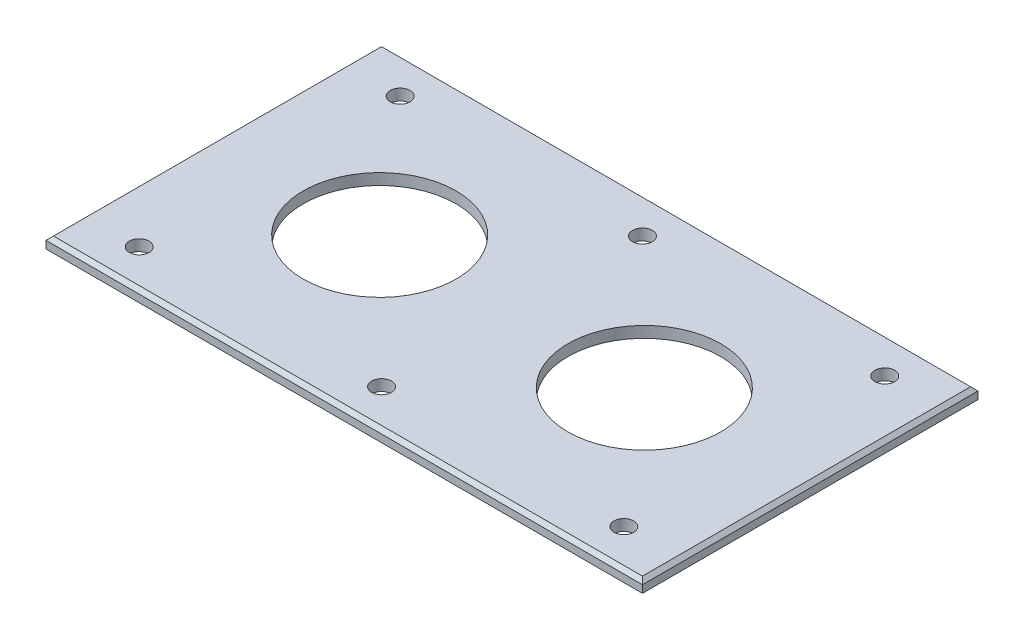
ISO-10303-21;
HEADER;
FILE_DESCRIPTION(('STEP AP214'),'2;1');
FILE_NAME('part.step','',(''),(''),'','','');
FILE_SCHEMA(('AUTOMOTIVE_DESIGN { 1 0 10303 214 1 1 1 1 }'));
ENDSEC;
DATA;
#1=APPLICATION_CONTEXT('core data for automotive mechanical design processes');
#2=APPLICATION_PROTOCOL_DEFINITION('international standard','automotive_design',2000,#1);
#3=PRODUCT_CONTEXT('',#1,'mechanical');
#4=PRODUCT('Part','Part','',(#3));
#5=PRODUCT_RELATED_PRODUCT_CATEGORY('part','',(#4));
#6=PRODUCT_DEFINITION_FORMATION('','',#4);
#7=PRODUCT_DEFINITION_CONTEXT('part definition',#1,'design');
#8=PRODUCT_DEFINITION('design','',#6,#7);
#9=PRODUCT_DEFINITION_SHAPE('','',#8);
#10=(LENGTH_UNIT() NAMED_UNIT(*) SI_UNIT(.MILLI.,.METRE.));
#11=(NAMED_UNIT(*) PLANE_ANGLE_UNIT() SI_UNIT($,.RADIAN.));
#12=(NAMED_UNIT(*) SI_UNIT($,.STERADIAN.) SOLID_ANGLE_UNIT());
#13=UNCERTAINTY_MEASURE_WITH_UNIT(LENGTH_MEASURE(1.E-05),#10,'distance_accuracy_value','');
#14=(GEOMETRIC_REPRESENTATION_CONTEXT(3) GLOBAL_UNCERTAINTY_ASSIGNED_CONTEXT((#13)) GLOBAL_UNIT_ASSIGNED_CONTEXT((#10,
#11,#12)) REPRESENTATION_CONTEXT('',''));
#15=CARTESIAN_POINT('',(0.,0.,0.));
#16=DIRECTION('',(0.,0.,1.));
#17=DIRECTION('',(1.,0.,0.));
#18=AXIS2_PLACEMENT_3D('',#15,#16,#17);
#19=CARTESIAN_POINT('',(0.,14.,0.));
#20=DIRECTION('',(-1.,0.,0.));
#21=DIRECTION('',(0.,0.,1.));
#22=AXIS2_PLACEMENT_3D('',#19,#20,#21);
#23=PLANE('',#22);
#24=DIRECTION('',(0.,-1.,0.));
#25=VECTOR('',#24,1.);
#26=CARTESIAN_POINT('',(0.,14.,-90.));
#27=LINE('',#26,#25);
#28=CARTESIAN_POINT('',(0.,15.,-90.));
#29=VERTEX_POINT('',#28);
#30=CARTESIAN_POINT('',(0.,13.,-90.));
#31=VERTEX_POINT('',#30);
#32=EDGE_CURVE('E100',#29,#31,#27,.T.);
#33=ORIENTED_EDGE('',*,*,#32,.F.);
#34=DIRECTION('',(0.,0.,1.));
#35=VECTOR('',#34,1.);
#36=CARTESIAN_POINT('',(0.,15.,0.));
#37=LINE('',#36,#35);
#38=CARTESIAN_POINT('',(0.,15.,0.));
#39=VERTEX_POINT('',#38);
#40=EDGE_CURVE('E46',#29,#39,#37,.T.);
#41=ORIENTED_EDGE('',*,*,#40,.T.);
#42=DIRECTION('',(0.,-1.,0.));
#43=VECTOR('',#42,1.);
#44=CARTESIAN_POINT('',(0.,14.,0.));
#45=LINE('',#44,#43);
#46=CARTESIAN_POINT('',(0.,13.,0.));
#47=VERTEX_POINT('',#46);
#48=EDGE_CURVE('E133',#39,#47,#45,.T.);
#49=ORIENTED_EDGE('',*,*,#48,.T.);
#50=DIRECTION('',(0.,0.,1.));
#51=VECTOR('',#50,1.);
#52=CARTESIAN_POINT('',(0.,13.,0.));
#53=LINE('',#52,#51);
#54=EDGE_CURVE('E114',#31,#47,#53,.T.);
#55=ORIENTED_EDGE('',*,*,#54,.F.);
#56=EDGE_LOOP('',(#33,#41,#49,#55));
#57=FACE_BOUND('',#56,.T.);
#58=ADVANCED_FACE('F36',(#57),#23,.F.);
#59=CARTESIAN_POINT('',(0.,14.,-90.));
#60=DIRECTION('',(0.,0.,1.));
#61=DIRECTION('',(1.,0.,0.));
#62=AXIS2_PLACEMENT_3D('',#59,#60,#61);
#63=PLANE('',#62);
#64=DIRECTION('',(0.,-1.,0.));
#65=VECTOR('',#64,1.);
#66=CARTESIAN_POINT('',(-160.,14.,-90.));
#67=LINE('',#66,#65);
#68=CARTESIAN_POINT('',(-160.,15.,-90.));
#69=VERTEX_POINT('',#68);
#70=CARTESIAN_POINT('',(-160.,13.,-90.));
#71=VERTEX_POINT('',#70);
#72=EDGE_CURVE('E91',#69,#71,#67,.T.);
#73=ORIENTED_EDGE('',*,*,#72,.F.);
#74=DIRECTION('',(1.,0.,0.));
#75=VECTOR('',#74,1.);
#76=CARTESIAN_POINT('',(0.,15.,-90.));
#77=LINE('',#76,#75);
#78=EDGE_CURVE('E61',#69,#29,#77,.T.);
#79=ORIENTED_EDGE('',*,*,#78,.T.);
#80=ORIENTED_EDGE('',*,*,#32,.T.);
#81=DIRECTION('',(1.,0.,0.));
#82=VECTOR('',#81,1.);
#83=CARTESIAN_POINT('',(-160.,13.,-90.));
#84=LINE('',#83,#82);
#85=EDGE_CURVE('E109',#71,#31,#84,.T.);
#86=ORIENTED_EDGE('',*,*,#85,.F.);
#87=EDGE_LOOP('',(#73,#79,#80,#86));
#88=FACE_BOUND('',#87,.T.);
#89=ADVANCED_FACE('F116',(#88),#63,.F.);
#90=CARTESIAN_POINT('',(-160.,14.,0.));
#91=DIRECTION('',(1.,0.,0.));
#92=DIRECTION('',(0.,0.,-1.));
#93=AXIS2_PLACEMENT_3D('',#90,#91,#92);
#94=PLANE('',#93);
#95=DIRECTION('',(0.,-1.,0.));
#96=VECTOR('',#95,1.);
#97=CARTESIAN_POINT('',(-160.,14.,0.));
#98=LINE('',#97,#96);
#99=CARTESIAN_POINT('',(-160.,15.,0.));
#100=VERTEX_POINT('',#99);
#101=CARTESIAN_POINT('',(-160.,13.,0.));
#102=VERTEX_POINT('',#101);
#103=EDGE_CURVE('E101',#100,#102,#98,.T.);
#104=ORIENTED_EDGE('',*,*,#103,.F.);
#105=DIRECTION('',(0.,0.,-1.));
#106=VECTOR('',#105,1.);
#107=CARTESIAN_POINT('',(-160.,15.,-90.));
#108=LINE('',#107,#106);
#109=EDGE_CURVE('E97',#100,#69,#108,.T.);
#110=ORIENTED_EDGE('',*,*,#109,.T.);
#111=ORIENTED_EDGE('',*,*,#72,.T.);
#112=DIRECTION('',(0.,0.,1.));
#113=VECTOR('',#112,1.);
#114=CARTESIAN_POINT('',(-160.,13.,0.));
#115=LINE('',#114,#113);
#116=EDGE_CURVE('E95',#71,#102,#115,.T.);
#117=ORIENTED_EDGE('',*,*,#116,.T.);
#118=EDGE_LOOP('',(#104,#110,#111,#117));
#119=FACE_BOUND('',#118,.T.);
#120=ADVANCED_FACE('F94',(#119),#94,.F.);
#121=CARTESIAN_POINT('',(0.,14.,0.));
#122=DIRECTION('',(0.,0.,-1.));
#123=DIRECTION('',(-1.,0.,0.));
#124=AXIS2_PLACEMENT_3D('',#121,#122,#123);
#125=PLANE('',#124);
#126=ORIENTED_EDGE('',*,*,#48,.F.);
#127=DIRECTION('',(-1.,0.,0.));
#128=VECTOR('',#127,1.);
#129=CARTESIAN_POINT('',(-160.,15.,0.));
#130=LINE('',#129,#128);
#131=EDGE_CURVE('E11',#39,#100,#130,.T.);
#132=ORIENTED_EDGE('',*,*,#131,.T.);
#133=ORIENTED_EDGE('',*,*,#103,.T.);
#134=DIRECTION('',(1.,0.,0.));
#135=VECTOR('',#134,1.);
#136=CARTESIAN_POINT('',(-160.,13.,0.));
#137=LINE('',#136,#135);
#138=EDGE_CURVE('E112',#102,#47,#137,.T.);
#139=ORIENTED_EDGE('',*,*,#138,.T.);
#140=EDGE_LOOP('',(#126,#132,#133,#139));
#141=FACE_BOUND('',#140,.T.);
#142=ADVANCED_FACE('F234',(#141),#125,.F.);
#143=CARTESIAN_POINT('',(0.,16.,0.));
#144=DIRECTION('',(0.,1.,0.));
#145=DIRECTION('',(0.,0.,1.));
#146=AXIS2_PLACEMENT_3D('',#143,#144,#145);
#147=PLANE('',#146);
#148=DIRECTION('',(-1.,0.,0.));
#149=VECTOR('',#148,1.);
#150=CARTESIAN_POINT('',(-160.,16.,-89.));
#151=LINE('',#150,#149);
#152=CARTESIAN_POINT('',(-1.00000000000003,16.,-89.));
#153=VERTEX_POINT('',#152);
#154=CARTESIAN_POINT('',(-159.,16.,-89.));
#155=VERTEX_POINT('',#154);
#156=EDGE_CURVE('E177',#153,#155,#151,.T.);
#157=ORIENTED_EDGE('',*,*,#156,.T.);
#158=DIRECTION('',(0.,0.,1.));
#159=VECTOR('',#158,1.);
#160=CARTESIAN_POINT('',(-159.,16.,0.));
#161=LINE('',#160,#159);
#162=CARTESIAN_POINT('',(-159.,16.,-1.00000000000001));
#163=VERTEX_POINT('',#162);
#164=EDGE_CURVE('E180',#155,#163,#161,.T.);
#165=ORIENTED_EDGE('',*,*,#164,.T.);
#166=DIRECTION('',(1.,0.,0.));
#167=VECTOR('',#166,1.);
#168=CARTESIAN_POINT('',(0.,16.,-1.00000000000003));
#169=LINE('',#168,#167);
#170=CARTESIAN_POINT('',(-1.00000000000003,16.,-1.00000000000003));
#171=VERTEX_POINT('',#170);
#172=EDGE_CURVE('E140',#163,#171,#169,.T.);
#173=ORIENTED_EDGE('',*,*,#172,.T.);
#174=DIRECTION('',(0.,0.,-1.));
#175=VECTOR('',#174,1.);
#176=CARTESIAN_POINT('',(-1.00000000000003,16.,-90.));
#177=LINE('',#176,#175);
#178=EDGE_CURVE('E174',#171,#153,#177,.T.);
#179=ORIENTED_EDGE('',*,*,#178,.T.);
#180=EDGE_LOOP('',(#157,#165,#173,#179));
#181=FACE_BOUND('',#180,.T.);
#182=CARTESIAN_POINT('',(-145.,16.,-9.99999999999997));
#183=DIRECTION('',(0.,1.,0.));
#184=DIRECTION('',(0.,0.,-1.));
#185=AXIS2_PLACEMENT_3D('',#182,#183,#184);
#186=CIRCLE('',#185,2.65000000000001);
#187=CARTESIAN_POINT('',(-145.,16.,-12.65));
#188=VERTEX_POINT('',#187);
#189=EDGE_CURVE('E171',#188,#188,#186,.T.);
#190=ORIENTED_EDGE('',*,*,#189,.F.);
#191=EDGE_LOOP('',(#190));
#192=FACE_BOUND('',#191,.T.);
#193=CARTESIAN_POINT('',(-80.0000000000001,16.,-9.99999999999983));
#194=DIRECTION('',(0.,1.,0.));
#195=DIRECTION('',(0.,0.,-1.));
#196=AXIS2_PLACEMENT_3D('',#193,#194,#195);
#197=CIRCLE('',#196,2.65);
#198=CARTESIAN_POINT('',(-80.0000000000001,16.,-12.6499999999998));
#199=VERTEX_POINT('',#198);
#200=EDGE_CURVE('E166',#199,#199,#197,.T.);
#201=ORIENTED_EDGE('',*,*,#200,.F.);
#202=EDGE_LOOP('',(#201));
#203=FACE_BOUND('',#202,.T.);
#204=CARTESIAN_POINT('',(-15.0000000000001,16.,-9.99999999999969));
#205=DIRECTION('',(0.,1.,0.));
#206=DIRECTION('',(0.,0.,-1.));
#207=AXIS2_PLACEMENT_3D('',#204,#205,#206);
#208=CIRCLE('',#207,2.65);
#209=CARTESIAN_POINT('',(-15.0000000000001,16.,-12.6499999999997));
#210=VERTEX_POINT('',#209);
#211=EDGE_CURVE('E161',#210,#210,#208,.T.);
#212=ORIENTED_EDGE('',*,*,#211,.F.);
#213=EDGE_LOOP('',(#212));
#214=FACE_BOUND('',#213,.T.);
#215=CARTESIAN_POINT('',(-15.,16.,-80.));
#216=DIRECTION('',(0.,1.,0.));
#217=DIRECTION('',(0.,0.,1.));
#218=AXIS2_PLACEMENT_3D('',#215,#216,#217);
#219=CIRCLE('',#218,2.65);
#220=CARTESIAN_POINT('',(-15.,16.,-77.35));
#221=VERTEX_POINT('',#220);
#222=EDGE_CURVE('E156',#221,#221,#219,.T.);
#223=ORIENTED_EDGE('',*,*,#222,.F.);
#224=EDGE_LOOP('',(#223));
#225=FACE_BOUND('',#224,.T.);
#226=CARTESIAN_POINT('',(-80.,16.,-80.));
#227=DIRECTION('',(0.,1.,0.));
#228=DIRECTION('',(0.,0.,1.));
#229=AXIS2_PLACEMENT_3D('',#226,#227,#228);
#230=CIRCLE('',#229,2.65);
#231=CARTESIAN_POINT('',(-80.,16.,-77.35));
#232=VERTEX_POINT('',#231);
#233=EDGE_CURVE('E151',#232,#232,#230,.T.);
#234=ORIENTED_EDGE('',*,*,#233,.F.);
#235=EDGE_LOOP('',(#234));
#236=FACE_BOUND('',#235,.T.);
#237=CARTESIAN_POINT('',(-145.,16.,-80.));
#238=DIRECTION('',(0.,1.,0.));
#239=DIRECTION('',(0.,0.,1.));
#240=AXIS2_PLACEMENT_3D('',#237,#238,#239);
#241=CIRCLE('',#240,2.65000000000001);
#242=CARTESIAN_POINT('',(-145.,16.,-77.35));
#243=VERTEX_POINT('',#242);
#244=EDGE_CURVE('E146',#243,#243,#241,.T.);
#245=ORIENTED_EDGE('',*,*,#244,.F.);
#246=EDGE_LOOP('',(#245));
#247=FACE_BOUND('',#246,.T.);
#248=CARTESIAN_POINT('',(-115.5,16.,-45.));
#249=DIRECTION('',(0.,1.,0.));
#250=DIRECTION('',(0.,0.,1.));
#251=AXIS2_PLACEMENT_3D('',#248,#249,#250);
#252=CIRCLE('',#251,20.5);
#253=CARTESIAN_POINT('',(-115.5,16.,-24.5));
#254=VERTEX_POINT('',#253);
#255=EDGE_CURVE('E129',#254,#254,#252,.T.);
#256=ORIENTED_EDGE('',*,*,#255,.F.);
#257=EDGE_LOOP('',(#256));
#258=FACE_BOUND('',#257,.T.);
#259=CARTESIAN_POINT('',(-44.5,16.,-45.));
#260=DIRECTION('',(0.,1.,0.));
#261=DIRECTION('',(0.,0.,1.));
#262=AXIS2_PLACEMENT_3D('',#259,#260,#261);
#263=CIRCLE('',#262,20.5);
#264=CARTESIAN_POINT('',(-44.5,16.,-24.5));
#265=VERTEX_POINT('',#264);
#266=EDGE_CURVE('E122',#265,#265,#263,.T.);
#267=ORIENTED_EDGE('',*,*,#266,.F.);
#268=EDGE_LOOP('',(#267));
#269=FACE_BOUND('',#268,.T.);
#270=ADVANCED_FACE('F243',(#181,#192,#203,#214,#225,#236,#247,#258,#269),#147,.T.);
#271=CARTESIAN_POINT('',(-115.5,16.,-45.));
#272=DIRECTION('',(0.,-1.,0.));
#273=DIRECTION('',(0.,0.,-1.));
#274=AXIS2_PLACEMENT_3D('',#271,#272,#273);
#275=CYLINDRICAL_SURFACE('',#274,20.5);
#276=ORIENTED_EDGE('',*,*,#255,.T.);
#277=EDGE_LOOP('',(#276));
#278=FACE_BOUND('',#277,.T.);
#279=CARTESIAN_POINT('',(-115.5,13.,-45.));
#280=DIRECTION('',(0.,-1.,0.));
#281=DIRECTION('',(0.,0.,-1.));
#282=AXIS2_PLACEMENT_3D('',#279,#280,#281);
#283=CIRCLE('',#282,20.5);
#284=CARTESIAN_POINT('',(-115.5,13.,-65.5));
#285=VERTEX_POINT('',#284);
#286=EDGE_CURVE('E229',#285,#285,#283,.T.);
#287=ORIENTED_EDGE('',*,*,#286,.T.);
#288=EDGE_LOOP('',(#287));
#289=FACE_BOUND('',#288,.T.);
#290=ADVANCED_FACE('F346',(#278,#289),#275,.F.);
#291=CARTESIAN_POINT('',(-44.5,16.,-45.));
#292=DIRECTION('',(0.,-1.,0.));
#293=DIRECTION('',(0.,0.,-1.));
#294=AXIS2_PLACEMENT_3D('',#291,#292,#293);
#295=CYLINDRICAL_SURFACE('',#294,20.5);
#296=ORIENTED_EDGE('',*,*,#266,.T.);
#297=EDGE_LOOP('',(#296));
#298=FACE_BOUND('',#297,.T.);
#299=CARTESIAN_POINT('',(-44.5,13.,-45.));
#300=DIRECTION('',(0.,-1.,0.));
#301=DIRECTION('',(0.,0.,-1.));
#302=AXIS2_PLACEMENT_3D('',#299,#300,#301);
#303=CIRCLE('',#302,20.5);
#304=CARTESIAN_POINT('',(-44.5,13.,-65.5));
#305=VERTEX_POINT('',#304);
#306=EDGE_CURVE('E145',#305,#305,#303,.T.);
#307=ORIENTED_EDGE('',*,*,#306,.T.);
#308=EDGE_LOOP('',(#307));
#309=FACE_BOUND('',#308,.T.);
#310=ADVANCED_FACE('F337',(#298,#309),#295,.F.);
#311=CARTESIAN_POINT('',(-160.,13.,0.));
#312=DIRECTION('',(0.,1.,0.));
#313=DIRECTION('',(0.,0.,1.));
#314=AXIS2_PLACEMENT_3D('',#311,#312,#313);
#315=PLANE('',#314);
#316=CARTESIAN_POINT('',(-145.,13.,-9.99999999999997));
#317=DIRECTION('',(0.,1.,0.));
#318=DIRECTION('',(0.,0.,1.));
#319=AXIS2_PLACEMENT_3D('',#316,#317,#318);
#320=CIRCLE('',#319,2.65000000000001);
#321=CARTESIAN_POINT('',(-145.,13.,-7.34999999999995));
#322=VERTEX_POINT('',#321);
#323=EDGE_CURVE('E167',#322,#322,#320,.T.);
#324=ORIENTED_EDGE('',*,*,#323,.T.);
#325=EDGE_LOOP('',(#324));
#326=FACE_BOUND('',#325,.T.);
#327=CARTESIAN_POINT('',(-80.0000000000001,13.,-9.99999999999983));
#328=DIRECTION('',(0.,1.,0.));
#329=DIRECTION('',(0.,0.,1.));
#330=AXIS2_PLACEMENT_3D('',#327,#328,#329);
#331=CIRCLE('',#330,2.65);
#332=CARTESIAN_POINT('',(-80.0000000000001,13.,-7.34999999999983));
#333=VERTEX_POINT('',#332);
#334=EDGE_CURVE('E162',#333,#333,#331,.T.);
#335=ORIENTED_EDGE('',*,*,#334,.T.);
#336=EDGE_LOOP('',(#335));
#337=FACE_BOUND('',#336,.T.);
#338=CARTESIAN_POINT('',(-15.0000000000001,13.,-9.99999999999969));
#339=DIRECTION('',(0.,1.,0.));
#340=DIRECTION('',(0.,0.,1.));
#341=AXIS2_PLACEMENT_3D('',#338,#339,#340);
#342=CIRCLE('',#341,2.65);
#343=CARTESIAN_POINT('',(-15.0000000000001,13.,-7.34999999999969));
#344=VERTEX_POINT('',#343);
#345=EDGE_CURVE('E157',#344,#344,#342,.T.);
#346=ORIENTED_EDGE('',*,*,#345,.T.);
#347=EDGE_LOOP('',(#346));
#348=FACE_BOUND('',#347,.T.);
#349=CARTESIAN_POINT('',(-15.,13.,-80.));
#350=DIRECTION('',(0.,1.,0.));
#351=DIRECTION('',(0.,0.,1.));
#352=AXIS2_PLACEMENT_3D('',#349,#350,#351);
#353=CIRCLE('',#352,2.65);
#354=CARTESIAN_POINT('',(-15.,13.,-77.35));
#355=VERTEX_POINT('',#354);
#356=EDGE_CURVE('E152',#355,#355,#353,.T.);
#357=ORIENTED_EDGE('',*,*,#356,.T.);
#358=EDGE_LOOP('',(#357));
#359=FACE_BOUND('',#358,.T.);
#360=CARTESIAN_POINT('',(-80.,13.,-80.));
#361=DIRECTION('',(0.,1.,0.));
#362=DIRECTION('',(0.,0.,1.));
#363=AXIS2_PLACEMENT_3D('',#360,#361,#362);
#364=CIRCLE('',#363,2.65);
#365=CARTESIAN_POINT('',(-80.,13.,-77.35));
#366=VERTEX_POINT('',#365);
#367=EDGE_CURVE('E147',#366,#366,#364,.T.);
#368=ORIENTED_EDGE('',*,*,#367,.T.);
#369=EDGE_LOOP('',(#368));
#370=FACE_BOUND('',#369,.T.);
#371=CARTESIAN_POINT('',(-145.,13.,-80.));
#372=DIRECTION('',(0.,1.,0.));
#373=DIRECTION('',(0.,0.,1.));
#374=AXIS2_PLACEMENT_3D('',#371,#372,#373);
#375=CIRCLE('',#374,2.65000000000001);
#376=CARTESIAN_POINT('',(-145.,13.,-77.35));
#377=VERTEX_POINT('',#376);
#378=EDGE_CURVE('E141',#377,#377,#375,.T.);
#379=ORIENTED_EDGE('',*,*,#378,.T.);
#380=EDGE_LOOP('',(#379));
#381=FACE_BOUND('',#380,.T.);
#382=ORIENTED_EDGE('',*,*,#54,.T.);
#383=ORIENTED_EDGE('',*,*,#138,.F.);
#384=ORIENTED_EDGE('',*,*,#116,.F.);
#385=ORIENTED_EDGE('',*,*,#85,.T.);
#386=EDGE_LOOP('',(#382,#383,#384,#385));
#387=FACE_BOUND('',#386,.T.);
#388=ORIENTED_EDGE('',*,*,#286,.F.);
#389=EDGE_LOOP('',(#388));
#390=FACE_BOUND('',#389,.T.);
#391=ORIENTED_EDGE('',*,*,#306,.F.);
#392=EDGE_LOOP('',(#391));
#393=FACE_BOUND('',#392,.T.);
#394=ADVANCED_FACE('F107',(#326,#337,#348,#359,#370,#381,#387,#390,#393),#315,.F.);
#395=CARTESIAN_POINT('',(-145.,5.,-80.));
#396=DIRECTION('',(0.,1.,0.));
#397=DIRECTION('',(0.,0.,1.));
#398=AXIS2_PLACEMENT_3D('',#395,#396,#397);
#399=CYLINDRICAL_SURFACE('',#398,2.65000000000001);
#400=ORIENTED_EDGE('',*,*,#244,.T.);
#401=EDGE_LOOP('',(#400));
#402=FACE_BOUND('',#401,.T.);
#403=ORIENTED_EDGE('',*,*,#378,.F.);
#404=EDGE_LOOP('',(#403));
#405=FACE_BOUND('',#404,.T.);
#406=ADVANCED_FACE('F320',(#402,#405),#399,.F.);
#407=CARTESIAN_POINT('',(-80.,5.,-80.));
#408=DIRECTION('',(0.,1.,0.));
#409=DIRECTION('',(0.,0.,1.));
#410=AXIS2_PLACEMENT_3D('',#407,#408,#409);
#411=CYLINDRICAL_SURFACE('',#410,2.65);
#412=ORIENTED_EDGE('',*,*,#233,.T.);
#413=EDGE_LOOP('',(#412));
#414=FACE_BOUND('',#413,.T.);
#415=ORIENTED_EDGE('',*,*,#367,.F.);
#416=EDGE_LOOP('',(#415));
#417=FACE_BOUND('',#416,.T.);
#418=ADVANCED_FACE('F311',(#414,#417),#411,.F.);
#419=CARTESIAN_POINT('',(-15.,5.,-80.));
#420=DIRECTION('',(0.,1.,0.));
#421=DIRECTION('',(0.,0.,1.));
#422=AXIS2_PLACEMENT_3D('',#419,#420,#421);
#423=CYLINDRICAL_SURFACE('',#422,2.65);
#424=ORIENTED_EDGE('',*,*,#222,.T.);
#425=EDGE_LOOP('',(#424));
#426=FACE_BOUND('',#425,.T.);
#427=ORIENTED_EDGE('',*,*,#356,.F.);
#428=EDGE_LOOP('',(#427));
#429=FACE_BOUND('',#428,.T.);
#430=ADVANCED_FACE('F302',(#426,#429),#423,.F.);
#431=CARTESIAN_POINT('',(-15.0000000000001,5.,-9.99999999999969));
#432=DIRECTION('',(0.,1.,0.));
#433=DIRECTION('',(0.,0.,1.));
#434=AXIS2_PLACEMENT_3D('',#431,#432,#433);
#435=CYLINDRICAL_SURFACE('',#434,2.65);
#436=ORIENTED_EDGE('',*,*,#211,.T.);
#437=EDGE_LOOP('',(#436));
#438=FACE_BOUND('',#437,.T.);
#439=ORIENTED_EDGE('',*,*,#345,.F.);
#440=EDGE_LOOP('',(#439));
#441=FACE_BOUND('',#440,.T.);
#442=ADVANCED_FACE('F293',(#438,#441),#435,.F.);
#443=CARTESIAN_POINT('',(-80.0000000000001,5.,-9.99999999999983));
#444=DIRECTION('',(0.,1.,0.));
#445=DIRECTION('',(0.,0.,1.));
#446=AXIS2_PLACEMENT_3D('',#443,#444,#445);
#447=CYLINDRICAL_SURFACE('',#446,2.65);
#448=ORIENTED_EDGE('',*,*,#200,.T.);
#449=EDGE_LOOP('',(#448));
#450=FACE_BOUND('',#449,.T.);
#451=ORIENTED_EDGE('',*,*,#334,.F.);
#452=EDGE_LOOP('',(#451));
#453=FACE_BOUND('',#452,.T.);
#454=ADVANCED_FACE('F284',(#450,#453),#447,.F.);
#455=CARTESIAN_POINT('',(-145.,5.,-9.99999999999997));
#456=DIRECTION('',(0.,1.,0.));
#457=DIRECTION('',(0.,0.,1.));
#458=AXIS2_PLACEMENT_3D('',#455,#456,#457);
#459=CYLINDRICAL_SURFACE('',#458,2.65000000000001);
#460=ORIENTED_EDGE('',*,*,#189,.T.);
#461=EDGE_LOOP('',(#460));
#462=FACE_BOUND('',#461,.T.);
#463=ORIENTED_EDGE('',*,*,#323,.F.);
#464=EDGE_LOOP('',(#463));
#465=FACE_BOUND('',#464,.T.);
#466=ADVANCED_FACE('F252',(#462,#465),#459,.F.);
#467=CARTESIAN_POINT('',(-1.00000000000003,16.,0.));
#468=DIRECTION('',(0.707106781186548,0.707106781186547,0.));
#469=DIRECTION('',(0.,0.,1.));
#470=AXIS2_PLACEMENT_3D('',#467,#468,#469);
#471=PLANE('',#470);
#472=DIRECTION('',(-0.577350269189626,0.577350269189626,-0.577350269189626));
#473=VECTOR('',#472,1.);
#474=CARTESIAN_POINT('',(-0.666666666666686,15.6666666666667,-0.666666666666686));
#475=LINE('',#474,#473);
#476=EDGE_CURVE('E194',#39,#171,#475,.T.);
#477=ORIENTED_EDGE('',*,*,#476,.F.);
#478=ORIENTED_EDGE('',*,*,#40,.F.);
#479=DIRECTION('',(-0.577350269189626,0.577350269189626,0.577350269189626));
#480=VECTOR('',#479,1.);
#481=CARTESIAN_POINT('',(-30.6666666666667,45.6666666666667,-59.3333333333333));
#482=LINE('',#481,#480);
#483=EDGE_CURVE('E40',#153,#29,#482,.F.);
#484=ORIENTED_EDGE('',*,*,#483,.F.);
#485=ORIENTED_EDGE('',*,*,#178,.F.);
#486=EDGE_LOOP('',(#477,#478,#484,#485));
#487=FACE_BOUND('',#486,.T.);
#488=ADVANCED_FACE('F38',(#487),#471,.T.);
#489=CARTESIAN_POINT('',(0.,16.,-89.));
#490=DIRECTION('',(0.,0.707106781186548,-0.707106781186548));
#491=DIRECTION('',(1.,0.,0.));
#492=AXIS2_PLACEMENT_3D('',#489,#490,#491);
#493=PLANE('',#492);
#494=ORIENTED_EDGE('',*,*,#483,.T.);
#495=ORIENTED_EDGE('',*,*,#78,.F.);
#496=DIRECTION('',(0.577350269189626,0.577350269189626,0.577350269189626));
#497=VECTOR('',#496,1.);
#498=CARTESIAN_POINT('',(-106.,69.,-36.));
#499=LINE('',#498,#497);
#500=EDGE_CURVE('E192',#155,#69,#499,.F.);
#501=ORIENTED_EDGE('',*,*,#500,.F.);
#502=ORIENTED_EDGE('',*,*,#156,.F.);
#503=EDGE_LOOP('',(#494,#495,#501,#502));
#504=FACE_BOUND('',#503,.T.);
#505=ADVANCED_FACE('F245',(#504),#493,.T.);
#506=CARTESIAN_POINT('',(0.,16.,-1.00000000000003));
#507=DIRECTION('',(0.,0.707106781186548,0.707106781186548));
#508=DIRECTION('',(-1.,0.,0.));
#509=AXIS2_PLACEMENT_3D('',#506,#507,#508);
#510=PLANE('',#509);
#511=ORIENTED_EDGE('',*,*,#476,.T.);
#512=ORIENTED_EDGE('',*,*,#172,.F.);
#513=DIRECTION('',(-0.577350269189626,-0.577350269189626,0.577350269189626));
#514=VECTOR('',#513,1.);
#515=CARTESIAN_POINT('',(-106.,69.,-54.));
#516=LINE('',#515,#514);
#517=EDGE_CURVE('E189',#100,#163,#516,.F.);
#518=ORIENTED_EDGE('',*,*,#517,.F.);
#519=ORIENTED_EDGE('',*,*,#131,.F.);
#520=EDGE_LOOP('',(#511,#512,#518,#519));
#521=FACE_BOUND('',#520,.T.);
#522=ADVANCED_FACE('F240',(#521),#510,.T.);
#523=CARTESIAN_POINT('',(-159.,16.,0.));
#524=DIRECTION('',(-0.707106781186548,0.707106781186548,0.));
#525=DIRECTION('',(0.,0.,-1.));
#526=AXIS2_PLACEMENT_3D('',#523,#524,#525);
#527=PLANE('',#526);
#528=ORIENTED_EDGE('',*,*,#500,.T.);
#529=ORIENTED_EDGE('',*,*,#109,.F.);
#530=ORIENTED_EDGE('',*,*,#517,.T.);
#531=ORIENTED_EDGE('',*,*,#164,.F.);
#532=EDGE_LOOP('',(#528,#529,#530,#531));
#533=FACE_BOUND('',#532,.T.);
#534=ADVANCED_FACE('F237',(#533),#527,.T.);
#535=CLOSED_SHELL('',(#58,#89,#120,#142,#270,#290,#310,#394,#406,#418,#430,#442,#454,#466,#488,
#505,#522,#534));
#536=MANIFOLD_SOLID_BREP('B2',#535);
#537=ADVANCED_BREP_SHAPE_REPRESENTATION('',(#18,#536),#14);
#538=SHAPE_DEFINITION_REPRESENTATION(#9,#537);
ENDSEC;
END-ISO-10303-21;
